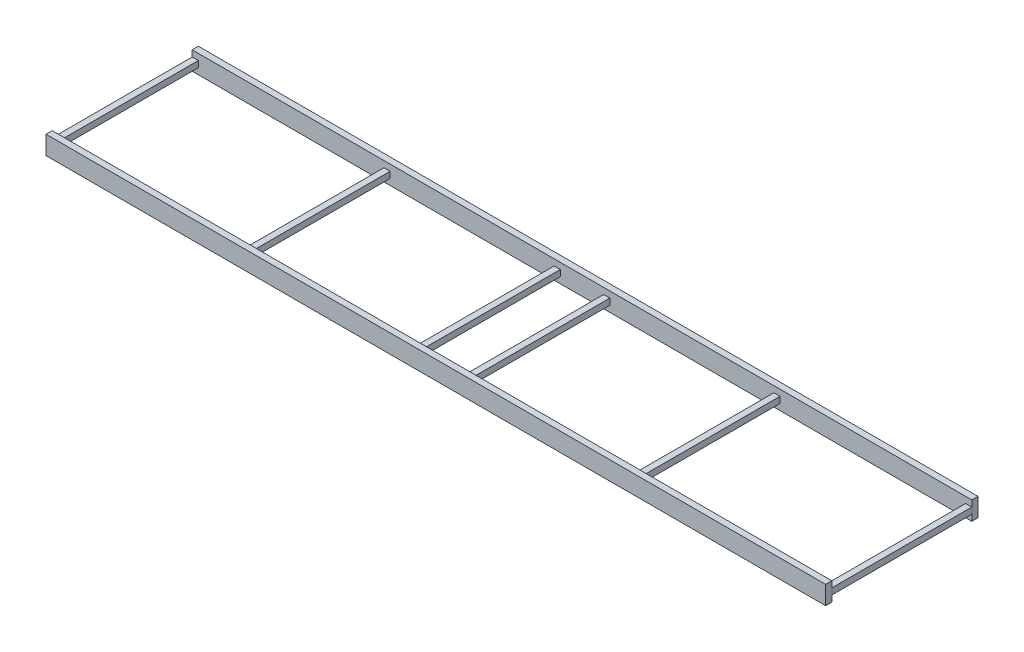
from build123d import *

# Parameters (mm, degrees)
SKETCH12_W                 = 3.175
SKETCH12_H                 = 9.525
STRUCTURAL_MEMBER1_DEPTH   = 400
SKETCH12_ON_SEGMENT_2_W    = 3.175
SKETCH12_ON_SEGMENT_2_H    = 9.525
STRUCTURAL_MEMBER1_2_DEPTH = 400
SKETCH14_W                 = 3.175
SKETCH14_H                 = 3.175
STRUCTURAL_MEMBER2_DEPTH   = 75
SKETCH15_W                 = 3.175
SKETCH15_H                 = 3.175
STRUCTURAL_MEMBER3_DEPTH   = 75
SKETCH16_W                 = 3.175
SKETCH16_H                 = 3.175
STRUCTURAL_MEMBER4_DEPTH   = 75
SKETCH16_ON_SEGMENT_2_W    = 3.175
SKETCH16_ON_SEGMENT_2_H    = 3.175
STRUCTURAL_MEMBER4_2_DEPTH = 75
SKETCH16_ON_SEGMENT_3_W    = 3.175
SKETCH16_ON_SEGMENT_3_H    = 3.175
STRUCTURAL_MEMBER4_3_DEPTH = 75
SKETCH16_ON_SEGMENT_4_W    = 3.175
SKETCH16_ON_SEGMENT_4_H    = 3.175
STRUCTURAL_MEMBER4_4_DEPTH = 75


with BuildPart() as part:
    # Sketch12 → Structural Member1 (new body)
    with BuildSketch(Plane(origin=(-200, 0, 37.5), x_dir=(0, 0, -1), z_dir=(1, 0, 0))):
        Rectangle(SKETCH12_W, SKETCH12_H)
    extrude(amount=STRUCTURAL_MEMBER1_DEPTH)


with BuildPart() as body_2:
    # Sketch12 on segment 2 (on carried to segment 2) → Structural Member1 2 (new body)
    with BuildSketch(Plane(origin=(-200, 0, -37.5), x_dir=(0, 0, -1), z_dir=(1, 0, 0))):
        Rectangle(SKETCH12_ON_SEGMENT_2_W, SKETCH12_ON_SEGMENT_2_H)
    extrude(amount=STRUCTURAL_MEMBER1_2_DEPTH)


with BuildPart() as body_3:
    # Sketch14 → Structural Member2 (new body)
    with BuildSketch(Plane(origin=(198.4125, 0, 37.5), x_dir=(-1, 0, 0), z_dir=(0, 0, -1))):
        Rectangle(SKETCH14_W, SKETCH14_H)
    extrude(amount=STRUCTURAL_MEMBER2_DEPTH)

    # Trim_Extend1 17: cut part
    add(part.part, mode=Mode.SUBTRACT)

    # Trim_Extend1 20
    split(bisect_by=Plane(origin=(0, 0, -35.9125), x_dir=(0, -1, 0), z_dir=(0, 0, 1)), keep=Keep.TOP)


with BuildPart() as body_4:
    # Sketch15 → Structural Member3 (new body)
    with BuildSketch(Plane(origin=(-198.4125, 0, 37.5), x_dir=(-1, 0, 0), z_dir=(0, 0, -1))):
        Rectangle(SKETCH15_W, SKETCH15_H)
    extrude(amount=STRUCTURAL_MEMBER3_DEPTH)

    # Trim_Extend1 17: cut part
    add(part.part, mode=Mode.SUBTRACT)

    # Trim_Extend1 34: cut body 2
    add(body_2.part, mode=Mode.SUBTRACT)


with BuildPart() as body_5:
    # Sketch16 → Structural Member4 (new body)
    with BuildSketch(Plane(origin=(-100, 0, -37.5), x_dir=(1, 0, 0), z_dir=(0, 0, 1))):
        Rectangle(SKETCH16_W, SKETCH16_H)
    extrude(amount=STRUCTURAL_MEMBER4_DEPTH)

    # Trim_Extend1
    split(bisect_by=Plane.YX.offset(-35.9125), keep=Keep.TOP)

    # Trim_Extend1 20
    split(bisect_by=Plane(origin=(0, 0, -35.9125), x_dir=(0, -1, 0), z_dir=(0, 0, 1)), keep=Keep.TOP)


with BuildPart() as body_6:
    # Sketch16 on segment 2 (on carried to segment 2) → Structural Member4 2 (new body)
    with BuildSketch(Plane(origin=(-12.7, 0, -37.5), x_dir=(1, 0, 0), z_dir=(0, 0, 1))):
        Rectangle(SKETCH16_ON_SEGMENT_2_W, SKETCH16_ON_SEGMENT_2_H)
    extrude(amount=STRUCTURAL_MEMBER4_2_DEPTH)

    # Trim_Extend1 17: cut part
    add(part.part, mode=Mode.SUBTRACT)

    # Trim_Extend1 34: cut body 2
    add(body_2.part, mode=Mode.SUBTRACT)


with BuildPart() as body_7:
    # Sketch16 on segment 3 (on carried to segment 3) → Structural Member4 3 (new body)
    with BuildSketch(Plane(origin=(12.7, 0, -37.5), x_dir=(1, 0, 0), z_dir=(0, 0, 1))):
        Rectangle(SKETCH16_ON_SEGMENT_3_W, SKETCH16_ON_SEGMENT_3_H)
    extrude(amount=STRUCTURAL_MEMBER4_3_DEPTH)

    # Trim_Extend1 17: cut part
    add(part.part, mode=Mode.SUBTRACT)

    # Trim_Extend1 34: cut body 2
    add(body_2.part, mode=Mode.SUBTRACT)


with BuildPart() as body_8:
    # Sketch16 on segment 4 (on carried to segment 4) → Structural Member4 4 (new body)
    with BuildSketch(Plane(origin=(100, 0, -37.5), x_dir=(1, 0, 0), z_dir=(0, 0, 1))):
        Rectangle(SKETCH16_ON_SEGMENT_4_W, SKETCH16_ON_SEGMENT_4_H)
    extrude(amount=STRUCTURAL_MEMBER4_4_DEPTH)

    # Trim_Extend1
    split(bisect_by=Plane.YX.offset(-35.9125), keep=Keep.TOP)

    # Trim_Extend1 20
    split(bisect_by=Plane(origin=(0, 0, -35.9125), x_dir=(0, -1, 0), z_dir=(0, 0, 1)), keep=Keep.TOP)


solid = Compound([part.part, body_2.part, body_3.part, body_4.part, body_5.part, body_6.part, body_7.part, body_8.part])
